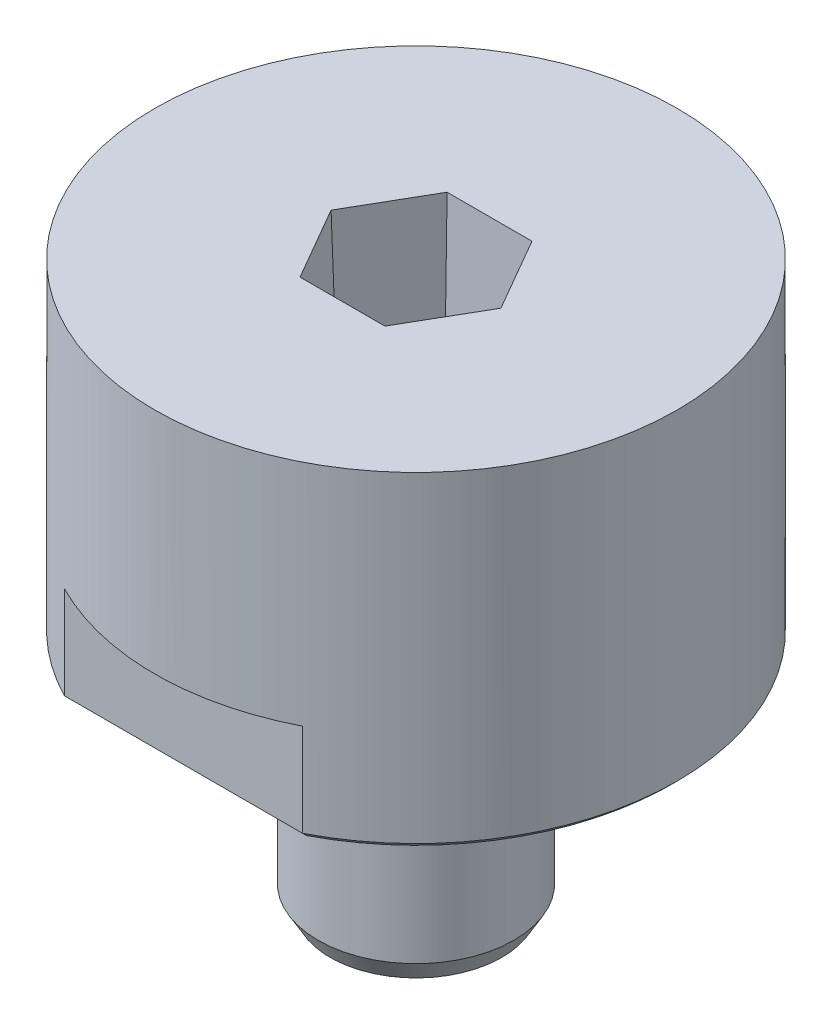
from build123d import *

# Parameters (mm, degrees)
CUT_EXTRUDE1_START = -4.7625
CUT_EXTRUDE1_DEPTH = 4.7625
CUT_EXTRUDE3_DEPTH = 11.43
CIRPATTERN1_COUNT  = 8
CHAMFER1_SIZE      = 0.254
DRAFT3_ANGLE       = 2


with BuildPart() as part:
    # Sketch1 → Revolve1 (revolve)
    with BuildSketch(Plane.XY, mode=Mode.PRIVATE) as revolve1_sk:
        with BuildLine():
            Line((0, 0), (4.175912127, 0))
            Line((4.175912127, 0), (4.7625, 1.016))
            Line((4.7625, 1.016), (4.7625, 7.112))
            Line((4.7625, 7.112), (4.4577, 7.112))
            Line((4.4577, 7.112), (4.4577, 7.5692))
            Line((4.4577, 7.5692), (4.7625, 7.5692))
            Line((4.7625, 7.5692), (4.7625, 10.668))
            ThreePointArc((4.7625, 10.668), (4.985684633, 11.206815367), (5.5245, 11.43))
            Line((5.5245, 11.43), (12.69746, 11.43))
            Line((12.69746, 11.43), (12.69746, 27.305))
            Line((12.69746, 27.305), (0, 27.305))
            Line((0, 27.305), (0, 0))
        make_face()
    revolve(revolve1_sk.sketch.rotate(Axis((0, 0, 0), (0, 1, 0)), 90), axis=Axis((0, 0, 0), (0, 1, 0)))

    # Sketch2 → Cut-Extrude1 (cut)
    with BuildSketch(Plane.XZ.offset(-11.43).offset(CUT_EXTRUDE1_START)):
        with BuildLine():
            Line((-5.78512588, 11.303), (5.78512588, 11.303))
            ThreePointArc((5.78512588, 11.303), (0, 12.69746), (-5.78512588, 11.303))
        make_face()
        with BuildLine():
            Line((-5.78512588, -11.303), (5.78512588, -11.303))
            ThreePointArc((5.78512588, -11.303), (0, -12.69746), (-5.78512588, -11.303))
        make_face()
    extrude(amount=CUT_EXTRUDE1_DEPTH, mode=Mode.SUBTRACT)

    # Sketch5 → Cut-Extrude3 (cut)
    with BuildSketch(Plane(origin=(0, 27.305, 0), x_dir=(1, 0, 0), z_dir=(0, 1, 0))):
        Polygon((1.833087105, 3.175), (-1.833087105, 3.175), (-3.666174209, 0), (-1.833087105, -3.175), (1.833087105, -3.175), (3.666174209, 0), align=None)
    extrude(amount=-CUT_EXTRUDE3_DEPTH, mode=Mode.SUBTRACT)

    # Sketch3 → Cut-Revolve1 (revolve, cut)
    with BuildSketch(Plane(origin=(0, 0, 0), x_dir=(0.7071067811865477, 0, -0.7071067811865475), z_dir=(0.7071067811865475, 0, 0.7071067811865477))):
        with BuildLine():
            Line((10.804384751, 11.43), (9.906, 11.43))
            Line((9.906, 11.43), (9.906, 11.811))
            ThreePointArc((9.906, 11.811), (10.393918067, 11.711813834), (10.804384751, 11.43))
        make_face()
    cut_revolve1 = revolve(axis=Axis((7.004599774, 10.56132, -7.004599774), (0, 1, 0)), mode=Mode.SUBTRACT)

    # CirPattern1: Cut-Revolve1 ×8 about axis
    cirpattern1_axis = Axis((0, 0, 0), (0, 1, 0))
    for i in range(1, CIRPATTERN1_COUNT):
        add(cut_revolve1.rotate(cirpattern1_axis, i * 360 / CIRPATTERN1_COUNT), mode=Mode.SUBTRACT)

    # Chamfer1
    chamfer1_edges = [part.edges().sort_by_distance(p)[0] for p in [
        (12.69746, 11.43, 0),
        (-12.69746, 11.43, 0),
        (0, 11.43, 11.303),
        (0, 11.43, -11.303),
    ]]
    chamfer(chamfer1_edges, length=CHAMFER1_SIZE)

    # Draft3
    draft3_faces = [part.faces().sort_by_distance(p)[0] for p in [
        (-2.749630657, 21.59, 1.5875),
        (-2.749630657, 21.59, -1.5875),
        (0, 21.59, -3.175),
        (2.749630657, 21.59, -1.5875),
        (2.749630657, 21.59, 1.5875),
        (0, 21.59, 3.175),
    ]]
    draft(draft3_faces, Plane.ZX.offset(15.875), DRAFT3_ANGLE)


with BuildPart() as body_2:
    # Sketch6 → Revolve2 (revolve)
    with BuildSketch(Plane.XY, mode=Mode.PRIVATE) as revolve2_sk:
        with BuildLine():
            Line((-4.671830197, 7.5692), (-5.048217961, 7.5692))
            ThreePointArc((-5.048217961, 7.5692), (-5.138020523, 7.532002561), (-5.175217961, 7.4422))
            Line((-5.175217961, 7.4422), (-5.175217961, 7.239))
            ThreePointArc((-5.175217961, 7.239), (-5.138020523, 7.149197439), (-5.048217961, 7.112))
            Line((-5.048217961, 7.112), (-4.671830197, 7.112))
            ThreePointArc((-4.671830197, 7.112), (-4.582027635, 7.149197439), (-4.544830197, 7.239))
            Line((-4.544830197, 7.239), (-4.544830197, 7.4422))
            ThreePointArc((-4.544830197, 7.4422), (-4.582027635, 7.532002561), (-4.671830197, 7.5692))
        make_face()
    revolve(revolve2_sk.sketch.rotate(Axis((0, 9.552482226, 0), (0, -1, 0)), 270), axis=Axis((0, 9.552482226, 0), (0, -1, 0)))


solid = Compound([part.part, body_2.part])
